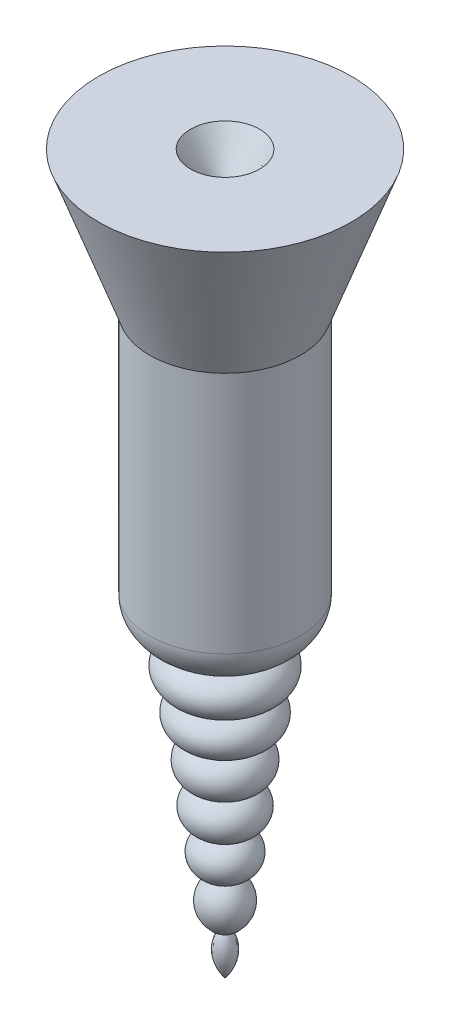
from build123d import *


with BuildPart() as part:
    # Sketch2 → Revolve1 (revolve)
    with BuildSketch(Plane.XY, mode=Mode.PRIVATE) as revolve1_sk:
        with BuildLine():
            Line((0, 0), (0, -11.809368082))
            add(Edge.make_bspline(
                [(0, -11.809368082), (0.292922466, -11.438195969), (0.094600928, -11.078710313)],
                knots=[5.84796007, 5.84796007, 5.84796007, 6.508953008, 6.508953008, 6.508953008], degree=2, weights=[1, 0.94588135, 1]))
            add(Edge.make_bspline(
                [(0.094600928, -11.078710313), (0.770515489, -10.707526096), (0.202428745, -10.233667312)],
                knots=[2.170820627, 2.170820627, 2.170820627, 3.908738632, 3.908738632, 3.908738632], degree=2, weights=[1, 0.645621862, 1]))
            add(Edge.make_bspline(
                [(0.202428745, -10.233667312), (1.128777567, -9.928519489), (0.256914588, -9.530238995)],
                knots=[5.09635253, 5.09635253, 5.09635253, 7.344413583, 7.344413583, 7.344413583], degree=2, weights=[1, 0.432051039, 1]))
            add(Edge.make_bspline(
                [(0.256914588, -9.530238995), (1.560224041, -9.2803065), (0.339423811, -8.822028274)],
                knots=[4.937079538, 4.937079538, 4.937079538, 7.434685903, 7.434685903, 7.434685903], degree=2, weights=[1, 0.316457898, 1]))
            add(Edge.make_bspline(
                [(0.339423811, -8.822028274), (0.666138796, -8.77290089), (0.675497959, -8.470133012), (0.684857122, -8.167365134), (0.361700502, -8.101379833)],
                knots=[4.875787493, 4.875787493, 4.875787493, 6.255319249, 6.255319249, 7.634851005, 7.634851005, 7.634851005], degree=2, weights=[1, 0.771395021, 1, 0.771395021, 1]))
            add(Edge.make_bspline(
                [(0.361700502, -8.101379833), (0.748901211, -8.101829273), (0.81148596, -7.796151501), (0.874070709, -7.490473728), (0.506946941, -7.391964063)],
                knots=[1.569897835, 1.569897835, 1.569897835, 2.979600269, 2.979600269, 4.389302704, 4.389302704, 4.389302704], degree=2, weights=[1, 0.761707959, 1, 0.761707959, 1]))
            add(Edge.make_bspline(
                [(0.506946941, -7.391964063), (0.930062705, -7.375943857), (0.952236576, -7.037537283), (0.974410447, -6.699130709), (0.55571599, -6.64767513)],
                knots=[1.618641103, 1.618641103, 1.618641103, 3.089575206, 3.089575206, 4.560509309, 4.560509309, 4.560509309], degree=2, weights=[1, 0.741517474, 1, 0.741517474, 1]))
            add(Edge.make_bspline(
                [(0.55571599, -6.64767513), (1.332095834, -6.534547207), (1.332095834, -5.90324555)],
                knots=[1.748553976, 1.748553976, 1.748553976, 3.140047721, 3.140047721, 3.140047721], degree=2, weights=[1, 0.767575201, 1]))
            Line((1.332095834, -5.90324555), (1.332095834, -1.606100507))
            Line((1.332095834, -1.606100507), (1.332095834, -1.602529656))
            Line((1.332095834, -1.602529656), (2.2352, 0.890631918))
            Line((2.2352, 0.890631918), (0.611730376, 0.890631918))
            Line((0.611730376, 0.890631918), (0, 0))
        make_face()
    revolve(revolve1_sk.sketch.rotate(Axis((0, 0, 0), (0, -1, 0)), 180), axis=Axis((0, 0, 0), (0, -1, 0)))


solid = part.part
